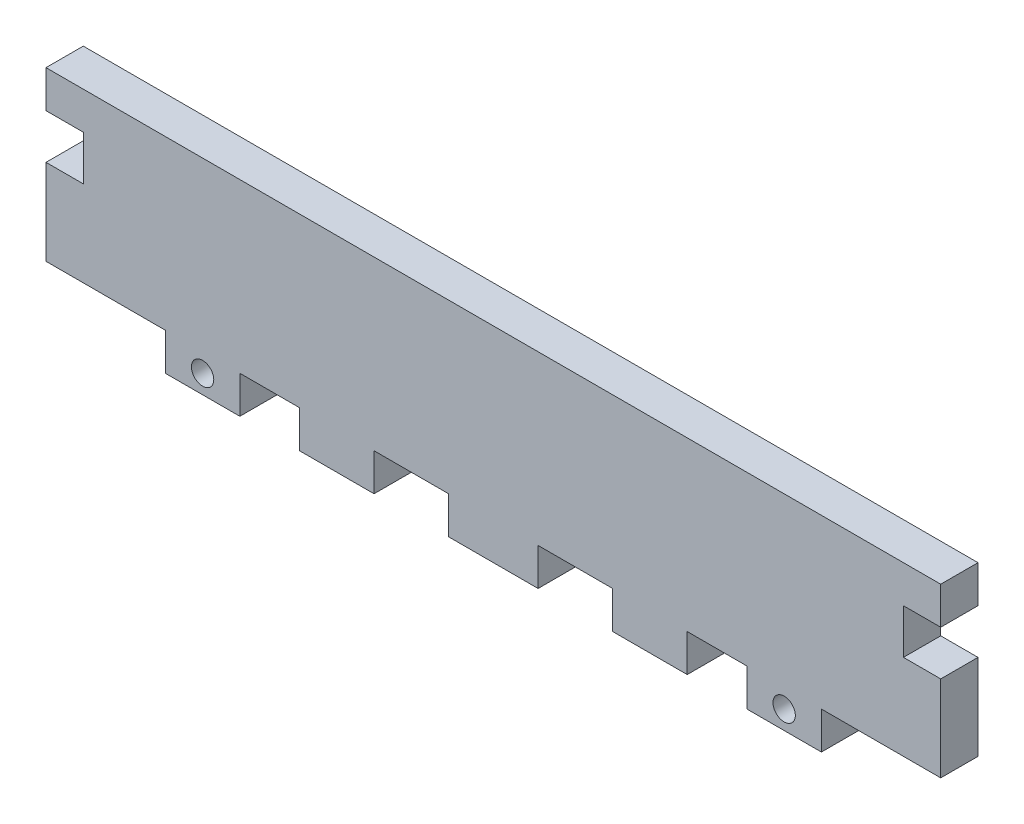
ISO-10303-21;
HEADER;
FILE_DESCRIPTION(('STEP AP214'),'2;1');
FILE_NAME('part.step','',(''),(''),'','','');
FILE_SCHEMA(('AUTOMOTIVE_DESIGN { 1 0 10303 214 1 1 1 1 }'));
ENDSEC;
DATA;
#1=APPLICATION_CONTEXT('core data for automotive mechanical design processes');
#2=APPLICATION_PROTOCOL_DEFINITION('international standard','automotive_design',2000,#1);
#3=PRODUCT_CONTEXT('',#1,'mechanical');
#4=PRODUCT('Part','Part','',(#3));
#5=PRODUCT_RELATED_PRODUCT_CATEGORY('part','',(#4));
#6=PRODUCT_DEFINITION_FORMATION('','',#4);
#7=PRODUCT_DEFINITION_CONTEXT('part definition',#1,'design');
#8=PRODUCT_DEFINITION('design','',#6,#7);
#9=PRODUCT_DEFINITION_SHAPE('','',#8);
#10=(LENGTH_UNIT() NAMED_UNIT(*) SI_UNIT(.MILLI.,.METRE.));
#11=(NAMED_UNIT(*) PLANE_ANGLE_UNIT() SI_UNIT($,.RADIAN.));
#12=(NAMED_UNIT(*) SI_UNIT($,.STERADIAN.) SOLID_ANGLE_UNIT());
#13=UNCERTAINTY_MEASURE_WITH_UNIT(LENGTH_MEASURE(1.E-05),#10,'distance_accuracy_value','');
#14=(GEOMETRIC_REPRESENTATION_CONTEXT(3) GLOBAL_UNCERTAINTY_ASSIGNED_CONTEXT((#13)) GLOBAL_UNIT_ASSIGNED_CONTEXT((#10,
#11,#12)) REPRESENTATION_CONTEXT('',''));
#15=CARTESIAN_POINT('',(0.,0.,0.));
#16=DIRECTION('',(0.,0.,1.));
#17=DIRECTION('',(1.,0.,0.));
#18=AXIS2_PLACEMENT_3D('',#15,#16,#17);
#19=CARTESIAN_POINT('',(0.,0.,6.35));
#20=DIRECTION('',(0.,1.,0.));
#21=DIRECTION('',(-1.,0.,0.));
#22=AXIS2_PLACEMENT_3D('',#19,#20,#21);
#23=PLANE('',#22);
#24=DIRECTION('',(0.,0.,-1.));
#25=VECTOR('',#24,1.);
#26=CARTESIAN_POINT('',(-55.88,0.,6.35));
#27=LINE('',#26,#25);
#28=CARTESIAN_POINT('',(-55.88,0.,6.35));
#29=VERTEX_POINT('',#28);
#30=CARTESIAN_POINT('',(-55.88,0.,0.));
#31=VERTEX_POINT('',#30);
#32=EDGE_CURVE('E73',#29,#31,#27,.T.);
#33=ORIENTED_EDGE('',*,*,#32,.F.);
#34=DIRECTION('',(1.,0.,0.));
#35=VECTOR('',#34,1.);
#36=CARTESIAN_POINT('',(0.,0.,6.35));
#37=LINE('',#36,#35);
#38=CARTESIAN_POINT('',(-68.58,0.,6.35));
#39=VERTEX_POINT('',#38);
#40=EDGE_CURVE('E633',#39,#29,#37,.T.);
#41=ORIENTED_EDGE('',*,*,#40,.F.);
#42=DIRECTION('',(0.,0.,1.));
#43=VECTOR('',#42,1.);
#44=CARTESIAN_POINT('',(-68.58,0.,0.));
#45=LINE('',#44,#43);
#46=CARTESIAN_POINT('',(-68.58,0.,0.));
#47=VERTEX_POINT('',#46);
#48=EDGE_CURVE('E404',#47,#39,#45,.T.);
#49=ORIENTED_EDGE('',*,*,#48,.F.);
#50=DIRECTION('',(1.,0.,0.));
#51=VECTOR('',#50,1.);
#52=CARTESIAN_POINT('',(0.,0.,0.));
#53=LINE('',#52,#51);
#54=EDGE_CURVE('E270',#47,#31,#53,.T.);
#55=ORIENTED_EDGE('',*,*,#54,.T.);
#56=EDGE_LOOP('',(#33,#41,#49,#55));
#57=FACE_BOUND('',#56,.T.);
#58=ADVANCED_FACE('F47',(#57),#23,.F.);
#59=DIRECTION('',(0.,0.,1.));
#60=VECTOR('',#59,1.);
#61=CARTESIAN_POINT('',(-43.18,0.,6.35));
#62=LINE('',#61,#60);
#63=CARTESIAN_POINT('',(-43.18,0.,0.));
#64=VERTEX_POINT('',#63);
#65=CARTESIAN_POINT('',(-43.18,0.,6.35));
#66=VERTEX_POINT('',#65);
#67=EDGE_CURVE('E274',#64,#66,#62,.T.);
#68=ORIENTED_EDGE('',*,*,#67,.F.);
#69=CARTESIAN_POINT('',(-33.02,0.,0.));
#70=VERTEX_POINT('',#69);
#71=EDGE_CURVE('E259',#64,#70,#53,.T.);
#72=ORIENTED_EDGE('',*,*,#71,.T.);
#73=DIRECTION('',(0.,0.,-1.));
#74=VECTOR('',#73,1.);
#75=CARTESIAN_POINT('',(-33.02,0.,6.35));
#76=LINE('',#75,#74);
#77=CARTESIAN_POINT('',(-33.02,0.,6.35));
#78=VERTEX_POINT('',#77);
#79=EDGE_CURVE('E327',#78,#70,#76,.T.);
#80=ORIENTED_EDGE('',*,*,#79,.F.);
#81=EDGE_CURVE('E65',#66,#78,#37,.T.);
#82=ORIENTED_EDGE('',*,*,#81,.F.);
#83=EDGE_LOOP('',(#68,#72,#80,#82));
#84=FACE_BOUND('',#83,.T.);
#85=ADVANCED_FACE('F275',(#84),#23,.F.);
#86=DIRECTION('',(0.,0.,1.));
#87=VECTOR('',#86,1.);
#88=CARTESIAN_POINT('',(-20.32,0.,6.35));
#89=LINE('',#88,#87);
#90=CARTESIAN_POINT('',(-20.32,0.,0.));
#91=VERTEX_POINT('',#90);
#92=CARTESIAN_POINT('',(-20.32,0.,6.35));
#93=VERTEX_POINT('',#92);
#94=EDGE_CURVE('E330',#91,#93,#89,.T.);
#95=ORIENTED_EDGE('',*,*,#94,.F.);
#96=CARTESIAN_POINT('',(0.,0.,0.));
#97=VERTEX_POINT('',#96);
#98=EDGE_CURVE('E271',#91,#97,#53,.T.);
#99=ORIENTED_EDGE('',*,*,#98,.T.);
#100=DIRECTION('',(0.,0.,-1.));
#101=VECTOR('',#100,1.);
#102=CARTESIAN_POINT('',(0.,0.,6.35));
#103=LINE('',#102,#101);
#104=CARTESIAN_POINT('',(0.,0.,6.35));
#105=VERTEX_POINT('',#104);
#106=EDGE_CURVE('E548',#105,#97,#103,.T.);
#107=ORIENTED_EDGE('',*,*,#106,.F.);
#108=EDGE_CURVE('E627',#93,#105,#37,.T.);
#109=ORIENTED_EDGE('',*,*,#108,.F.);
#110=EDGE_LOOP('',(#95,#99,#107,#109));
#111=FACE_BOUND('',#110,.T.);
#112=ADVANCED_FACE('F663',(#111),#23,.F.);
#113=DIRECTION('',(0.,0.,-1.));
#114=VECTOR('',#113,1.);
#115=CARTESIAN_POINT('',(-109.22,0.,6.35));
#116=LINE('',#115,#114);
#117=CARTESIAN_POINT('',(-109.22,0.,6.35));
#118=VERTEX_POINT('',#117);
#119=CARTESIAN_POINT('',(-109.22,0.,0.));
#120=VERTEX_POINT('',#119);
#121=EDGE_CURVE('E367',#118,#120,#116,.T.);
#122=ORIENTED_EDGE('',*,*,#121,.F.);
#123=CARTESIAN_POINT('',(-119.38,0.,6.35));
#124=VERTEX_POINT('',#123);
#125=EDGE_CURVE('E482',#124,#118,#37,.T.);
#126=ORIENTED_EDGE('',*,*,#125,.F.);
#127=DIRECTION('',(0.,0.,1.));
#128=VECTOR('',#127,1.);
#129=CARTESIAN_POINT('',(-119.38,0.,6.35));
#130=LINE('',#129,#128);
#131=CARTESIAN_POINT('',(-119.38,0.,0.));
#132=VERTEX_POINT('',#131);
#133=EDGE_CURVE('E426',#132,#124,#130,.T.);
#134=ORIENTED_EDGE('',*,*,#133,.F.);
#135=EDGE_CURVE('E517',#132,#120,#53,.T.);
#136=ORIENTED_EDGE('',*,*,#135,.T.);
#137=EDGE_LOOP('',(#122,#126,#134,#136));
#138=FACE_BOUND('',#137,.T.);
#139=ADVANCED_FACE('F735',(#138),#23,.F.);
#140=DIRECTION('',(0.,0.,1.));
#141=VECTOR('',#140,1.);
#142=CARTESIAN_POINT('',(-96.52,0.,6.35));
#143=LINE('',#142,#141);
#144=CARTESIAN_POINT('',(-96.52,0.,0.));
#145=VERTEX_POINT('',#144);
#146=CARTESIAN_POINT('',(-96.52,0.,6.35));
#147=VERTEX_POINT('',#146);
#148=EDGE_CURVE('E363',#145,#147,#143,.T.);
#149=ORIENTED_EDGE('',*,*,#148,.F.);
#150=CARTESIAN_POINT('',(-83.82,0.,0.));
#151=VERTEX_POINT('',#150);
#152=EDGE_CURVE('E686',#145,#151,#53,.T.);
#153=ORIENTED_EDGE('',*,*,#152,.T.);
#154=DIRECTION('',(0.,0.,-1.));
#155=VECTOR('',#154,1.);
#156=CARTESIAN_POINT('',(-83.82,0.,0.));
#157=LINE('',#156,#155);
#158=CARTESIAN_POINT('',(-83.82,0.,6.35));
#159=VERTEX_POINT('',#158);
#160=EDGE_CURVE('E400',#159,#151,#157,.T.);
#161=ORIENTED_EDGE('',*,*,#160,.F.);
#162=EDGE_CURVE('E629',#147,#159,#37,.T.);
#163=ORIENTED_EDGE('',*,*,#162,.F.);
#164=EDGE_LOOP('',(#149,#153,#161,#163));
#165=FACE_BOUND('',#164,.T.);
#166=ADVANCED_FACE('F722',(#165),#23,.F.);
#167=DIRECTION('',(0.,0.,-1.));
#168=VECTOR('',#167,1.);
#169=CARTESIAN_POINT('',(-132.08,0.,6.35));
#170=LINE('',#169,#168);
#171=CARTESIAN_POINT('',(-132.08,0.,6.35));
#172=VERTEX_POINT('',#171);
#173=CARTESIAN_POINT('',(-132.08,0.,0.));
#174=VERTEX_POINT('',#173);
#175=EDGE_CURVE('E409',#172,#174,#170,.T.);
#176=ORIENTED_EDGE('',*,*,#175,.F.);
#177=CARTESIAN_POINT('',(-152.4,0.,6.35));
#178=VERTEX_POINT('',#177);
#179=EDGE_CURVE('E477',#178,#172,#37,.T.);
#180=ORIENTED_EDGE('',*,*,#179,.F.);
#181=DIRECTION('',(0.,0.,-1.));
#182=VECTOR('',#181,1.);
#183=CARTESIAN_POINT('',(-152.4,0.,6.35));
#184=LINE('',#183,#182);
#185=CARTESIAN_POINT('',(-152.4,0.,0.));
#186=VERTEX_POINT('',#185);
#187=EDGE_CURVE('E552',#178,#186,#184,.T.);
#188=ORIENTED_EDGE('',*,*,#187,.T.);
#189=EDGE_CURVE('E273',#186,#174,#53,.T.);
#190=ORIENTED_EDGE('',*,*,#189,.T.);
#191=EDGE_LOOP('',(#176,#180,#188,#190));
#192=FACE_BOUND('',#191,.T.);
#193=ADVANCED_FACE('F692',(#192),#23,.F.);
#194=CARTESIAN_POINT('',(0.,28.575,6.35));
#195=DIRECTION('',(0.,1.,0.));
#196=DIRECTION('',(-1.,0.,0.));
#197=AXIS2_PLACEMENT_3D('',#194,#195,#196);
#198=PLANE('',#197);
#199=DIRECTION('',(1.,0.,0.));
#200=VECTOR('',#199,1.);
#201=CARTESIAN_POINT('',(0.,28.575,0.));
#202=LINE('',#201,#200);
#203=CARTESIAN_POINT('',(-152.4,28.575,0.));
#204=VERTEX_POINT('',#203);
#205=CARTESIAN_POINT('',(0.,28.575,0.));
#206=VERTEX_POINT('',#205);
#207=EDGE_CURVE('E457',#204,#206,#202,.T.);
#208=ORIENTED_EDGE('',*,*,#207,.F.);
#209=DIRECTION('',(0.,0.,-1.));
#210=VECTOR('',#209,1.);
#211=CARTESIAN_POINT('',(-152.4,28.575,6.35));
#212=LINE('',#211,#210);
#213=CARTESIAN_POINT('',(-152.4,28.575,6.35));
#214=VERTEX_POINT('',#213);
#215=EDGE_CURVE('E11',#214,#204,#212,.T.);
#216=ORIENTED_EDGE('',*,*,#215,.F.);
#217=DIRECTION('',(1.,0.,0.));
#218=VECTOR('',#217,1.);
#219=CARTESIAN_POINT('',(0.,28.575,6.35));
#220=LINE('',#219,#218);
#221=CARTESIAN_POINT('',(0.,28.575,6.35));
#222=VERTEX_POINT('',#221);
#223=EDGE_CURVE('E458',#214,#222,#220,.T.);
#224=ORIENTED_EDGE('',*,*,#223,.T.);
#225=DIRECTION('',(0.,0.,-1.));
#226=VECTOR('',#225,1.);
#227=CARTESIAN_POINT('',(0.,28.575,6.35));
#228=LINE('',#227,#226);
#229=EDGE_CURVE('E533',#222,#206,#228,.T.);
#230=ORIENTED_EDGE('',*,*,#229,.T.);
#231=EDGE_LOOP('',(#208,#216,#224,#230));
#232=FACE_BOUND('',#231,.T.);
#233=ADVANCED_FACE('F49',(#232),#198,.T.);
#234=CARTESIAN_POINT('',(-152.4,0.,6.35));
#235=DIRECTION('',(1.,0.,0.));
#236=DIRECTION('',(0.,0.,-1.));
#237=AXIS2_PLACEMENT_3D('',#234,#235,#236);
#238=PLANE('',#237);
#239=DIRECTION('',(0.,-1.,0.));
#240=VECTOR('',#239,1.);
#241=CARTESIAN_POINT('',(-152.4,0.,0.));
#242=LINE('',#241,#240);
#243=CARTESIAN_POINT('',(-152.4,22.225,0.));
#244=VERTEX_POINT('',#243);
#245=EDGE_CURVE('E500',#204,#244,#242,.T.);
#246=ORIENTED_EDGE('',*,*,#245,.T.);
#247=DIRECTION('',(0.,0.,-1.));
#248=VECTOR('',#247,1.);
#249=CARTESIAN_POINT('',(-152.4,22.225,6.35));
#250=LINE('',#249,#248);
#251=CARTESIAN_POINT('',(-152.4,22.225,6.35));
#252=VERTEX_POINT('',#251);
#253=EDGE_CURVE('E57',#252,#244,#250,.T.);
#254=ORIENTED_EDGE('',*,*,#253,.F.);
#255=DIRECTION('',(0.,-1.,0.));
#256=VECTOR('',#255,1.);
#257=CARTESIAN_POINT('',(-152.4,0.,6.35));
#258=LINE('',#257,#256);
#259=EDGE_CURVE('E462',#214,#252,#258,.T.);
#260=ORIENTED_EDGE('',*,*,#259,.F.);
#261=ORIENTED_EDGE('',*,*,#215,.T.);
#262=EDGE_LOOP('',(#246,#254,#260,#261));
#263=FACE_BOUND('',#262,.T.);
#264=ADVANCED_FACE('F605',(#263),#238,.F.);
#265=CARTESIAN_POINT('',(0.,22.225,6.35));
#266=DIRECTION('',(0.,1.,0.));
#267=DIRECTION('',(0.,0.,1.));
#268=AXIS2_PLACEMENT_3D('',#265,#266,#267);
#269=PLANE('',#268);
#270=DIRECTION('',(1.,0.,0.));
#271=VECTOR('',#270,1.);
#272=CARTESIAN_POINT('',(0.,22.225,0.));
#273=LINE('',#272,#271);
#274=CARTESIAN_POINT('',(-146.05,22.225,0.));
#275=VERTEX_POINT('',#274);
#276=EDGE_CURVE('E503',#244,#275,#273,.T.);
#277=ORIENTED_EDGE('',*,*,#276,.T.);
#278=DIRECTION('',(0.,0.,-1.));
#279=VECTOR('',#278,1.);
#280=CARTESIAN_POINT('',(-146.05,22.225,6.35));
#281=LINE('',#280,#279);
#282=CARTESIAN_POINT('',(-146.05,22.225,6.35));
#283=VERTEX_POINT('',#282);
#284=EDGE_CURVE('E562',#283,#275,#281,.T.);
#285=ORIENTED_EDGE('',*,*,#284,.F.);
#286=DIRECTION('',(1.,0.,0.));
#287=VECTOR('',#286,1.);
#288=CARTESIAN_POINT('',(0.,22.225,6.35));
#289=LINE('',#288,#287);
#290=EDGE_CURVE('E466',#252,#283,#289,.T.);
#291=ORIENTED_EDGE('',*,*,#290,.F.);
#292=ORIENTED_EDGE('',*,*,#253,.T.);
#293=EDGE_LOOP('',(#277,#285,#291,#292));
#294=FACE_BOUND('',#293,.T.);
#295=ADVANCED_FACE('F610',(#294),#269,.F.);
#296=CARTESIAN_POINT('',(-146.05,0.,6.35));
#297=DIRECTION('',(1.,0.,0.));
#298=DIRECTION('',(0.,0.,-1.));
#299=AXIS2_PLACEMENT_3D('',#296,#297,#298);
#300=PLANE('',#299);
#301=DIRECTION('',(0.,-1.,0.));
#302=VECTOR('',#301,1.);
#303=CARTESIAN_POINT('',(-146.05,0.,0.));
#304=LINE('',#303,#302);
#305=CARTESIAN_POINT('',(-146.05,14.605,0.));
#306=VERTEX_POINT('',#305);
#307=EDGE_CURVE('E507',#275,#306,#304,.T.);
#308=ORIENTED_EDGE('',*,*,#307,.T.);
#309=DIRECTION('',(0.,0.,-1.));
#310=VECTOR('',#309,1.);
#311=CARTESIAN_POINT('',(-146.05,14.605,6.35));
#312=LINE('',#311,#310);
#313=CARTESIAN_POINT('',(-146.05,14.605,6.35));
#314=VERTEX_POINT('',#313);
#315=EDGE_CURVE('E559',#314,#306,#312,.T.);
#316=ORIENTED_EDGE('',*,*,#315,.F.);
#317=DIRECTION('',(0.,-1.,0.));
#318=VECTOR('',#317,1.);
#319=CARTESIAN_POINT('',(-146.05,0.,6.35));
#320=LINE('',#319,#318);
#321=EDGE_CURVE('E470',#283,#314,#320,.T.);
#322=ORIENTED_EDGE('',*,*,#321,.F.);
#323=ORIENTED_EDGE('',*,*,#284,.T.);
#324=EDGE_LOOP('',(#308,#316,#322,#323));
#325=FACE_BOUND('',#324,.T.);
#326=ADVANCED_FACE('F615',(#325),#300,.F.);
#327=CARTESIAN_POINT('',(0.,14.605,6.35));
#328=DIRECTION('',(0.,1.,0.));
#329=DIRECTION('',(0.,0.,1.));
#330=AXIS2_PLACEMENT_3D('',#327,#328,#329);
#331=PLANE('',#330);
#332=DIRECTION('',(1.,0.,0.));
#333=VECTOR('',#332,1.);
#334=CARTESIAN_POINT('',(0.,14.605,0.));
#335=LINE('',#334,#333);
#336=CARTESIAN_POINT('',(-152.4,14.605,0.));
#337=VERTEX_POINT('',#336);
#338=EDGE_CURVE('E511',#337,#306,#335,.T.);
#339=ORIENTED_EDGE('',*,*,#338,.F.);
#340=DIRECTION('',(0.,0.,-1.));
#341=VECTOR('',#340,1.);
#342=CARTESIAN_POINT('',(-152.4,14.605,6.35));
#343=LINE('',#342,#341);
#344=CARTESIAN_POINT('',(-152.4,14.605,6.35));
#345=VERTEX_POINT('',#344);
#346=EDGE_CURVE('E556',#345,#337,#343,.T.);
#347=ORIENTED_EDGE('',*,*,#346,.F.);
#348=DIRECTION('',(1.,0.,0.));
#349=VECTOR('',#348,1.);
#350=CARTESIAN_POINT('',(0.,14.605,6.35));
#351=LINE('',#350,#349);
#352=EDGE_CURVE('E473',#345,#314,#351,.T.);
#353=ORIENTED_EDGE('',*,*,#352,.T.);
#354=ORIENTED_EDGE('',*,*,#315,.T.);
#355=EDGE_LOOP('',(#339,#347,#353,#354));
#356=FACE_BOUND('',#355,.T.);
#357=ADVANCED_FACE('F619',(#356),#331,.T.);
#358=EDGE_CURVE('E504',#337,#186,#242,.T.);
#359=ORIENTED_EDGE('',*,*,#358,.T.);
#360=ORIENTED_EDGE('',*,*,#187,.F.);
#361=EDGE_CURVE('E467',#345,#178,#258,.T.);
#362=ORIENTED_EDGE('',*,*,#361,.F.);
#363=ORIENTED_EDGE('',*,*,#346,.T.);
#364=EDGE_LOOP('',(#359,#360,#362,#363));
#365=FACE_BOUND('',#364,.T.);
#366=ADVANCED_FACE('F624',(#365),#238,.F.);
#367=CARTESIAN_POINT('',(0.,0.,6.35));
#368=DIRECTION('',(1.,0.,0.));
#369=DIRECTION('',(0.,0.,-1.));
#370=AXIS2_PLACEMENT_3D('',#367,#368,#369);
#371=PLANE('',#370);
#372=DIRECTION('',(0.,-1.,0.));
#373=VECTOR('',#372,1.);
#374=CARTESIAN_POINT('',(0.,0.,0.));
#375=LINE('',#374,#373);
#376=CARTESIAN_POINT('',(0.,14.605,0.));
#377=VERTEX_POINT('',#376);
#378=EDGE_CURVE('E516',#377,#97,#375,.T.);
#379=ORIENTED_EDGE('',*,*,#378,.F.);
#380=DIRECTION('',(0.,0.,-1.));
#381=VECTOR('',#380,1.);
#382=CARTESIAN_POINT('',(0.,14.605,6.35));
#383=LINE('',#382,#381);
#384=CARTESIAN_POINT('',(0.,14.605,6.35));
#385=VERTEX_POINT('',#384);
#386=EDGE_CURVE('E545',#385,#377,#383,.T.);
#387=ORIENTED_EDGE('',*,*,#386,.F.);
#388=DIRECTION('',(0.,-1.,0.));
#389=VECTOR('',#388,1.);
#390=CARTESIAN_POINT('',(0.,0.,6.35));
#391=LINE('',#390,#389);
#392=EDGE_CURVE('E481',#385,#105,#391,.T.);
#393=ORIENTED_EDGE('',*,*,#392,.T.);
#394=ORIENTED_EDGE('',*,*,#106,.T.);
#395=EDGE_LOOP('',(#379,#387,#393,#394));
#396=FACE_BOUND('',#395,.T.);
#397=ADVANCED_FACE('F666',(#396),#371,.T.);
#398=CARTESIAN_POINT('',(0.,14.605,6.35));
#399=DIRECTION('',(0.,-1.,0.));
#400=DIRECTION('',(1.,0.,0.));
#401=AXIS2_PLACEMENT_3D('',#398,#399,#400);
#402=PLANE('',#401);
#403=DIRECTION('',(-1.,0.,0.));
#404=VECTOR('',#403,1.);
#405=CARTESIAN_POINT('',(0.,14.605,0.));
#406=LINE('',#405,#404);
#407=CARTESIAN_POINT('',(-6.35,14.605,0.));
#408=VERTEX_POINT('',#407);
#409=EDGE_CURVE('E521',#377,#408,#406,.T.);
#410=ORIENTED_EDGE('',*,*,#409,.T.);
#411=DIRECTION('',(0.,0.,-1.));
#412=VECTOR('',#411,1.);
#413=CARTESIAN_POINT('',(-6.35,14.605,6.35));
#414=LINE('',#413,#412);
#415=CARTESIAN_POINT('',(-6.35,14.605,6.35));
#416=VERTEX_POINT('',#415);
#417=EDGE_CURVE('E542',#416,#408,#414,.T.);
#418=ORIENTED_EDGE('',*,*,#417,.F.);
#419=DIRECTION('',(-1.,0.,0.));
#420=VECTOR('',#419,1.);
#421=CARTESIAN_POINT('',(0.,14.605,6.35));
#422=LINE('',#421,#420);
#423=EDGE_CURVE('E486',#385,#416,#422,.T.);
#424=ORIENTED_EDGE('',*,*,#423,.F.);
#425=ORIENTED_EDGE('',*,*,#386,.T.);
#426=EDGE_LOOP('',(#410,#418,#424,#425));
#427=FACE_BOUND('',#426,.T.);
#428=ADVANCED_FACE('F671',(#427),#402,.F.);
#429=CARTESIAN_POINT('',(-6.34999999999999,0.,6.35));
#430=DIRECTION('',(1.,0.,0.));
#431=DIRECTION('',(0.,1.,0.));
#432=AXIS2_PLACEMENT_3D('',#429,#430,#431);
#433=PLANE('',#432);
#434=DIRECTION('',(0.,-1.,0.));
#435=VECTOR('',#434,1.);
#436=CARTESIAN_POINT('',(-6.34999999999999,0.,0.));
#437=LINE('',#436,#435);
#438=CARTESIAN_POINT('',(-6.35,22.225,0.));
#439=VERTEX_POINT('',#438);
#440=EDGE_CURVE('E525',#439,#408,#437,.T.);
#441=ORIENTED_EDGE('',*,*,#440,.F.);
#442=DIRECTION('',(0.,0.,-1.));
#443=VECTOR('',#442,1.);
#444=CARTESIAN_POINT('',(-6.35,22.225,6.35));
#445=LINE('',#444,#443);
#446=CARTESIAN_POINT('',(-6.35,22.225,6.35));
#447=VERTEX_POINT('',#446);
#448=EDGE_CURVE('E539',#447,#439,#445,.T.);
#449=ORIENTED_EDGE('',*,*,#448,.F.);
#450=DIRECTION('',(0.,-1.,0.));
#451=VECTOR('',#450,1.);
#452=CARTESIAN_POINT('',(-6.34999999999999,0.,6.35));
#453=LINE('',#452,#451);
#454=EDGE_CURVE('E490',#447,#416,#453,.T.);
#455=ORIENTED_EDGE('',*,*,#454,.T.);
#456=ORIENTED_EDGE('',*,*,#417,.T.);
#457=EDGE_LOOP('',(#441,#449,#455,#456));
#458=FACE_BOUND('',#457,.T.);
#459=ADVANCED_FACE('F675',(#458),#433,.T.);
#460=CARTESIAN_POINT('',(0.,22.225,6.35));
#461=DIRECTION('',(0.,-1.,0.));
#462=DIRECTION('',(0.,0.,-1.));
#463=AXIS2_PLACEMENT_3D('',#460,#461,#462);
#464=PLANE('',#463);
#465=DIRECTION('',(-1.,0.,0.));
#466=VECTOR('',#465,1.);
#467=CARTESIAN_POINT('',(0.,22.225,0.));
#468=LINE('',#467,#466);
#469=CARTESIAN_POINT('',(0.,22.225,0.));
#470=VERTEX_POINT('',#469);
#471=EDGE_CURVE('E529',#470,#439,#468,.T.);
#472=ORIENTED_EDGE('',*,*,#471,.F.);
#473=DIRECTION('',(0.,0.,-1.));
#474=VECTOR('',#473,1.);
#475=CARTESIAN_POINT('',(0.,22.225,6.35));
#476=LINE('',#475,#474);
#477=CARTESIAN_POINT('',(0.,22.225,6.35));
#478=VERTEX_POINT('',#477);
#479=EDGE_CURVE('E536',#478,#470,#476,.T.);
#480=ORIENTED_EDGE('',*,*,#479,.F.);
#481=DIRECTION('',(-1.,0.,0.));
#482=VECTOR('',#481,1.);
#483=CARTESIAN_POINT('',(0.,22.225,6.35));
#484=LINE('',#483,#482);
#485=EDGE_CURVE('E494',#478,#447,#484,.T.);
#486=ORIENTED_EDGE('',*,*,#485,.T.);
#487=ORIENTED_EDGE('',*,*,#448,.T.);
#488=EDGE_LOOP('',(#472,#480,#486,#487));
#489=FACE_BOUND('',#488,.T.);
#490=ADVANCED_FACE('F678',(#489),#464,.T.);
#491=EDGE_CURVE('E463',#206,#470,#375,.T.);
#492=ORIENTED_EDGE('',*,*,#491,.F.);
#493=ORIENTED_EDGE('',*,*,#229,.F.);
#494=EDGE_CURVE('E487',#222,#478,#391,.T.);
#495=ORIENTED_EDGE('',*,*,#494,.T.);
#496=ORIENTED_EDGE('',*,*,#479,.T.);
#497=EDGE_LOOP('',(#492,#493,#495,#496));
#498=FACE_BOUND('',#497,.T.);
#499=ADVANCED_FACE('F592',(#498),#371,.T.);
#500=CARTESIAN_POINT('',(0.,0.,6.35));
#501=DIRECTION('',(0.,0.,1.));
#502=DIRECTION('',(1.,0.,0.));
#503=AXIS2_PLACEMENT_3D('',#500,#501,#502);
#504=PLANE('',#503);
#505=CARTESIAN_POINT('',(-125.73,-3.17500000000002,6.35));
#506=DIRECTION('',(0.,0.,1.));
#507=DIRECTION('',(1.,0.,0.));
#508=AXIS2_PLACEMENT_3D('',#505,#506,#507);
#509=CIRCLE('',#508,1.90500000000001);
#510=CARTESIAN_POINT('',(-123.825,-3.17500000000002,6.35));
#511=VERTEX_POINT('',#510);
#512=EDGE_CURVE('E571',#511,#511,#509,.T.);
#513=ORIENTED_EDGE('',*,*,#512,.F.);
#514=EDGE_LOOP('',(#513));
#515=FACE_BOUND('',#514,.T.);
#516=CARTESIAN_POINT('',(-26.67,-3.175,6.35));
#517=DIRECTION('',(0.,0.,1.));
#518=DIRECTION('',(1.,0.,0.));
#519=AXIS2_PLACEMENT_3D('',#516,#517,#518);
#520=CIRCLE('',#519,1.905);
#521=CARTESIAN_POINT('',(-24.765,-3.175,6.35));
#522=VERTEX_POINT('',#521);
#523=EDGE_CURVE('E578',#522,#522,#520,.T.);
#524=ORIENTED_EDGE('',*,*,#523,.F.);
#525=EDGE_LOOP('',(#524));
#526=FACE_BOUND('',#525,.T.);
#527=ORIENTED_EDGE('',*,*,#223,.F.);
#528=ORIENTED_EDGE('',*,*,#259,.T.);
#529=ORIENTED_EDGE('',*,*,#290,.T.);
#530=ORIENTED_EDGE('',*,*,#321,.T.);
#531=ORIENTED_EDGE('',*,*,#352,.F.);
#532=ORIENTED_EDGE('',*,*,#361,.T.);
#533=ORIENTED_EDGE('',*,*,#179,.T.);
#534=DIRECTION('',(0.,1.,0.));
#535=VECTOR('',#534,1.);
#536=CARTESIAN_POINT('',(-132.08,-6.35000000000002,6.35));
#537=LINE('',#536,#535);
#538=CARTESIAN_POINT('',(-132.08,-6.35000000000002,6.35));
#539=VERTEX_POINT('',#538);
#540=EDGE_CURVE('E435',#539,#172,#537,.T.);
#541=ORIENTED_EDGE('',*,*,#540,.F.);
#542=DIRECTION('',(-1.,0.,0.));
#543=VECTOR('',#542,1.);
#544=CARTESIAN_POINT('',(-132.08,-6.35000000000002,6.35));
#545=LINE('',#544,#543);
#546=CARTESIAN_POINT('',(-119.38,-6.35000000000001,6.35));
#547=VERTEX_POINT('',#546);
#548=EDGE_CURVE('E432',#547,#539,#545,.T.);
#549=ORIENTED_EDGE('',*,*,#548,.F.);
#550=DIRECTION('',(0.,1.,0.));
#551=VECTOR('',#550,1.);
#552=CARTESIAN_POINT('',(-119.38,-6.35000000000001,6.35));
#553=LINE('',#552,#551);
#554=EDGE_CURVE('E445',#547,#124,#553,.T.);
#555=ORIENTED_EDGE('',*,*,#554,.T.);
#556=ORIENTED_EDGE('',*,*,#125,.T.);
#557=DIRECTION('',(0.,1.,0.));
#558=VECTOR('',#557,1.);
#559=CARTESIAN_POINT('',(-109.22,-6.35000000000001,6.35));
#560=LINE('',#559,#558);
#561=CARTESIAN_POINT('',(-109.22,-6.35000000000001,6.35));
#562=VERTEX_POINT('',#561);
#563=EDGE_CURVE('E358',#562,#118,#560,.T.);
#564=ORIENTED_EDGE('',*,*,#563,.F.);
#565=DIRECTION('',(-1.,0.,0.));
#566=VECTOR('',#565,1.);
#567=CARTESIAN_POINT('',(-109.22,-6.35000000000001,6.35));
#568=LINE('',#567,#566);
#569=CARTESIAN_POINT('',(-96.52,-6.35000000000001,6.35));
#570=VERTEX_POINT('',#569);
#571=EDGE_CURVE('E362',#570,#562,#568,.T.);
#572=ORIENTED_EDGE('',*,*,#571,.F.);
#573=DIRECTION('',(0.,1.,0.));
#574=VECTOR('',#573,1.);
#575=CARTESIAN_POINT('',(-96.52,-6.35000000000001,6.35));
#576=LINE('',#575,#574);
#577=EDGE_CURVE('E354',#570,#147,#576,.T.);
#578=ORIENTED_EDGE('',*,*,#577,.T.);
#579=ORIENTED_EDGE('',*,*,#162,.T.);
#580=DIRECTION('',(0.,1.,0.));
#581=VECTOR('',#580,1.);
#582=CARTESIAN_POINT('',(-83.82,-6.35000000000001,6.35));
#583=LINE('',#582,#581);
#584=CARTESIAN_POINT('',(-83.82,-6.35000000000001,6.35));
#585=VERTEX_POINT('',#584);
#586=EDGE_CURVE('E387',#585,#159,#583,.T.);
#587=ORIENTED_EDGE('',*,*,#586,.F.);
#588=DIRECTION('',(-1.,0.,0.));
#589=VECTOR('',#588,1.);
#590=CARTESIAN_POINT('',(-83.82,-6.35000000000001,6.35));
#591=LINE('',#590,#589);
#592=CARTESIAN_POINT('',(-68.58,-6.35000000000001,6.35));
#593=VERTEX_POINT('',#592);
#594=EDGE_CURVE('E415',#593,#585,#591,.T.);
#595=ORIENTED_EDGE('',*,*,#594,.F.);
#596=DIRECTION('',(0.,1.,0.));
#597=VECTOR('',#596,1.);
#598=CARTESIAN_POINT('',(-68.58,-6.35000000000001,6.35));
#599=LINE('',#598,#597);
#600=EDGE_CURVE('E372',#593,#39,#599,.T.);
#601=ORIENTED_EDGE('',*,*,#600,.T.);
#602=ORIENTED_EDGE('',*,*,#40,.T.);
#603=DIRECTION('',(0.,1.,0.));
#604=VECTOR('',#603,1.);
#605=CARTESIAN_POINT('',(-55.88,-6.35000000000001,6.35));
#606=LINE('',#605,#604);
#607=CARTESIAN_POINT('',(-55.88,-6.35000000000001,6.35));
#608=VERTEX_POINT('',#607);
#609=EDGE_CURVE('E290',#608,#29,#606,.T.);
#610=ORIENTED_EDGE('',*,*,#609,.F.);
#611=DIRECTION('',(-1.,0.,0.));
#612=VECTOR('',#611,1.);
#613=CARTESIAN_POINT('',(-55.88,-6.35000000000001,6.35));
#614=LINE('',#613,#612);
#615=CARTESIAN_POINT('',(-43.18,-6.35,6.35));
#616=VERTEX_POINT('',#615);
#617=EDGE_CURVE('E298',#616,#608,#614,.T.);
#618=ORIENTED_EDGE('',*,*,#617,.F.);
#619=DIRECTION('',(0.,1.,0.));
#620=VECTOR('',#619,1.);
#621=CARTESIAN_POINT('',(-43.18,-6.35,6.35));
#622=LINE('',#621,#620);
#623=EDGE_CURVE('E285',#616,#66,#622,.T.);
#624=ORIENTED_EDGE('',*,*,#623,.T.);
#625=ORIENTED_EDGE('',*,*,#81,.T.);
#626=DIRECTION('',(0.,1.,0.));
#627=VECTOR('',#626,1.);
#628=CARTESIAN_POINT('',(-33.02,-6.35,6.35));
#629=LINE('',#628,#627);
#630=CARTESIAN_POINT('',(-33.02,-6.35,6.35));
#631=VERTEX_POINT('',#630);
#632=EDGE_CURVE('E316',#631,#78,#629,.T.);
#633=ORIENTED_EDGE('',*,*,#632,.F.);
#634=DIRECTION('',(-1.,0.,0.));
#635=VECTOR('',#634,1.);
#636=CARTESIAN_POINT('',(-20.32,-6.35,6.35));
#637=LINE('',#636,#635);
#638=CARTESIAN_POINT('',(-20.32,-6.35,6.35));
#639=VERTEX_POINT('',#638);
#640=EDGE_CURVE('E341',#639,#631,#637,.T.);
#641=ORIENTED_EDGE('',*,*,#640,.F.);
#642=DIRECTION('',(0.,1.,0.));
#643=VECTOR('',#642,1.);
#644=CARTESIAN_POINT('',(-20.32,-6.35,6.35));
#645=LINE('',#644,#643);
#646=EDGE_CURVE('E302',#639,#93,#645,.T.);
#647=ORIENTED_EDGE('',*,*,#646,.T.);
#648=ORIENTED_EDGE('',*,*,#108,.T.);
#649=ORIENTED_EDGE('',*,*,#392,.F.);
#650=ORIENTED_EDGE('',*,*,#423,.T.);
#651=ORIENTED_EDGE('',*,*,#454,.F.);
#652=ORIENTED_EDGE('',*,*,#485,.F.);
#653=ORIENTED_EDGE('',*,*,#494,.F.);
#654=EDGE_LOOP('',(#527,#528,#529,#530,#531,#532,#533,#541,#549,#555,#556,#564,#572,#578,#579,
#587,#595,#601,#602,#610,#618,#624,#625,#633,#641,#647,#648,#649,#650,#651,#652,#653));
#655=FACE_BOUND('',#654,.T.);
#656=ADVANCED_FACE('F589',(#515,#526,#655),#504,.T.);
#657=CARTESIAN_POINT('',(0.,0.,0.));
#658=DIRECTION('',(0.,0.,1.));
#659=DIRECTION('',(1.,0.,0.));
#660=AXIS2_PLACEMENT_3D('',#657,#658,#659);
#661=PLANE('',#660);
#662=CARTESIAN_POINT('',(-125.73,-3.17500000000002,0.));
#663=DIRECTION('',(0.,0.,1.));
#664=DIRECTION('',(1.,0.,0.));
#665=AXIS2_PLACEMENT_3D('',#662,#663,#664);
#666=CIRCLE('',#665,1.90500000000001);
#667=CARTESIAN_POINT('',(-123.825,-3.17500000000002,0.));
#668=VERTEX_POINT('',#667);
#669=EDGE_CURVE('E51',#668,#668,#666,.T.);
#670=ORIENTED_EDGE('',*,*,#669,.T.);
#671=EDGE_LOOP('',(#670));
#672=FACE_BOUND('',#671,.T.);
#673=CARTESIAN_POINT('',(-26.67,-3.175,0.));
#674=DIRECTION('',(0.,0.,1.));
#675=DIRECTION('',(1.,0.,0.));
#676=AXIS2_PLACEMENT_3D('',#673,#674,#675);
#677=CIRCLE('',#676,1.905);
#678=CARTESIAN_POINT('',(-24.765,-3.175,0.));
#679=VERTEX_POINT('',#678);
#680=EDGE_CURVE('E568',#679,#679,#677,.T.);
#681=ORIENTED_EDGE('',*,*,#680,.T.);
#682=EDGE_LOOP('',(#681));
#683=FACE_BOUND('',#682,.T.);
#684=ORIENTED_EDGE('',*,*,#207,.T.);
#685=ORIENTED_EDGE('',*,*,#491,.T.);
#686=ORIENTED_EDGE('',*,*,#471,.T.);
#687=ORIENTED_EDGE('',*,*,#440,.T.);
#688=ORIENTED_EDGE('',*,*,#409,.F.);
#689=ORIENTED_EDGE('',*,*,#378,.T.);
#690=ORIENTED_EDGE('',*,*,#98,.F.);
#691=DIRECTION('',(0.,1.,0.));
#692=VECTOR('',#691,1.);
#693=CARTESIAN_POINT('',(-20.32,-6.35,0.));
#694=LINE('',#693,#692);
#695=CARTESIAN_POINT('',(-20.32,-6.35,0.));
#696=VERTEX_POINT('',#695);
#697=EDGE_CURVE('E322',#696,#91,#694,.T.);
#698=ORIENTED_EDGE('',*,*,#697,.F.);
#699=DIRECTION('',(1.,0.,0.));
#700=VECTOR('',#699,1.);
#701=CARTESIAN_POINT('',(-20.32,-6.35,0.));
#702=LINE('',#701,#700);
#703=CARTESIAN_POINT('',(-33.02,-6.35,0.));
#704=VERTEX_POINT('',#703);
#705=EDGE_CURVE('E326',#704,#696,#702,.T.);
#706=ORIENTED_EDGE('',*,*,#705,.F.);
#707=DIRECTION('',(0.,1.,0.));
#708=VECTOR('',#707,1.);
#709=CARTESIAN_POINT('',(-33.02,-6.35,0.));
#710=LINE('',#709,#708);
#711=EDGE_CURVE('E267',#704,#70,#710,.T.);
#712=ORIENTED_EDGE('',*,*,#711,.T.);
#713=ORIENTED_EDGE('',*,*,#71,.F.);
#714=DIRECTION('',(0.,1.,0.));
#715=VECTOR('',#714,1.);
#716=CARTESIAN_POINT('',(-43.18,-6.35,0.));
#717=LINE('',#716,#715);
#718=CARTESIAN_POINT('',(-43.18,-6.35,0.));
#719=VERTEX_POINT('',#718);
#720=EDGE_CURVE('E263',#719,#64,#717,.T.);
#721=ORIENTED_EDGE('',*,*,#720,.F.);
#722=DIRECTION('',(1.,0.,0.));
#723=VECTOR('',#722,1.);
#724=CARTESIAN_POINT('',(-55.88,-6.35000000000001,0.));
#725=LINE('',#724,#723);
#726=CARTESIAN_POINT('',(-55.88,-6.35000000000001,0.));
#727=VERTEX_POINT('',#726);
#728=EDGE_CURVE('E307',#727,#719,#725,.T.);
#729=ORIENTED_EDGE('',*,*,#728,.F.);
#730=DIRECTION('',(0.,1.,0.));
#731=VECTOR('',#730,1.);
#732=CARTESIAN_POINT('',(-55.88,-6.35000000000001,0.));
#733=LINE('',#732,#731);
#734=EDGE_CURVE('E286',#727,#31,#733,.T.);
#735=ORIENTED_EDGE('',*,*,#734,.T.);
#736=ORIENTED_EDGE('',*,*,#54,.F.);
#737=DIRECTION('',(0.,1.,0.));
#738=VECTOR('',#737,1.);
#739=CARTESIAN_POINT('',(-68.58,-6.35000000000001,0.));
#740=LINE('',#739,#738);
#741=CARTESIAN_POINT('',(-68.58,-6.35000000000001,0.));
#742=VERTEX_POINT('',#741);
#743=EDGE_CURVE('E395',#742,#47,#740,.T.);
#744=ORIENTED_EDGE('',*,*,#743,.F.);
#745=DIRECTION('',(1.,0.,0.));
#746=VECTOR('',#745,1.);
#747=CARTESIAN_POINT('',(-83.82,-6.35000000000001,0.));
#748=LINE('',#747,#746);
#749=CARTESIAN_POINT('',(-83.82,-6.35000000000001,0.));
#750=VERTEX_POINT('',#749);
#751=EDGE_CURVE('E399',#750,#742,#748,.T.);
#752=ORIENTED_EDGE('',*,*,#751,.F.);
#753=DIRECTION('',(0.,1.,0.));
#754=VECTOR('',#753,1.);
#755=CARTESIAN_POINT('',(-83.82,-6.35000000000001,0.));
#756=LINE('',#755,#754);
#757=EDGE_CURVE('E391',#750,#151,#756,.T.);
#758=ORIENTED_EDGE('',*,*,#757,.T.);
#759=ORIENTED_EDGE('',*,*,#152,.F.);
#760=DIRECTION('',(0.,1.,0.));
#761=VECTOR('',#760,1.);
#762=CARTESIAN_POINT('',(-96.52,-6.35000000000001,0.));
#763=LINE('',#762,#761);
#764=CARTESIAN_POINT('',(-96.52,-6.35000000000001,0.));
#765=VERTEX_POINT('',#764);
#766=EDGE_CURVE('E350',#765,#145,#763,.T.);
#767=ORIENTED_EDGE('',*,*,#766,.F.);
#768=DIRECTION('',(1.,0.,0.));
#769=VECTOR('',#768,1.);
#770=CARTESIAN_POINT('',(-109.22,-6.35000000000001,0.));
#771=LINE('',#770,#769);
#772=CARTESIAN_POINT('',(-109.22,-6.35000000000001,0.));
#773=VERTEX_POINT('',#772);
#774=EDGE_CURVE('E378',#773,#765,#771,.T.);
#775=ORIENTED_EDGE('',*,*,#774,.F.);
#776=DIRECTION('',(0.,1.,0.));
#777=VECTOR('',#776,1.);
#778=CARTESIAN_POINT('',(-109.22,-6.35000000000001,0.));
#779=LINE('',#778,#777);
#780=EDGE_CURVE('E335',#773,#120,#779,.T.);
#781=ORIENTED_EDGE('',*,*,#780,.T.);
#782=ORIENTED_EDGE('',*,*,#135,.F.);
#783=DIRECTION('',(0.,1.,0.));
#784=VECTOR('',#783,1.);
#785=CARTESIAN_POINT('',(-119.38,-6.35000000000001,0.));
#786=LINE('',#785,#784);
#787=CARTESIAN_POINT('',(-119.38,-6.35000000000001,0.));
#788=VERTEX_POINT('',#787);
#789=EDGE_CURVE('E449',#788,#132,#786,.T.);
#790=ORIENTED_EDGE('',*,*,#789,.F.);
#791=DIRECTION('',(1.,0.,0.));
#792=VECTOR('',#791,1.);
#793=CARTESIAN_POINT('',(-132.08,-6.35000000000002,0.));
#794=LINE('',#793,#792);
#795=CARTESIAN_POINT('',(-132.08,-6.35000000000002,0.));
#796=VERTEX_POINT('',#795);
#797=EDGE_CURVE('E425',#796,#788,#794,.T.);
#798=ORIENTED_EDGE('',*,*,#797,.F.);
#799=DIRECTION('',(0.,1.,0.));
#800=VECTOR('',#799,1.);
#801=CARTESIAN_POINT('',(-132.08,-6.35000000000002,0.));
#802=LINE('',#801,#800);
#803=EDGE_CURVE('E453',#796,#174,#802,.T.);
#804=ORIENTED_EDGE('',*,*,#803,.T.);
#805=ORIENTED_EDGE('',*,*,#189,.F.);
#806=ORIENTED_EDGE('',*,*,#358,.F.);
#807=ORIENTED_EDGE('',*,*,#338,.T.);
#808=ORIENTED_EDGE('',*,*,#307,.F.);
#809=ORIENTED_EDGE('',*,*,#276,.F.);
#810=ORIENTED_EDGE('',*,*,#245,.F.);
#811=EDGE_LOOP('',(#684,#685,#686,#687,#688,#689,#690,#698,#706,#712,#713,#721,#729,#735,#736,
#744,#752,#758,#759,#767,#775,#781,#782,#790,#798,#804,#805,#806,#807,#808,#809,#810));
#812=FACE_BOUND('',#811,.T.);
#813=ADVANCED_FACE('F261',(#672,#683,#812),#661,.F.);
#814=CARTESIAN_POINT('',(-132.08,-6.35000000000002,6.35));
#815=DIRECTION('',(1.,0.,0.));
#816=DIRECTION('',(0.,1.,0.));
#817=AXIS2_PLACEMENT_3D('',#814,#815,#816);
#818=PLANE('',#817);
#819=ORIENTED_EDGE('',*,*,#175,.T.);
#820=ORIENTED_EDGE('',*,*,#803,.F.);
#821=DIRECTION('',(0.,0.,-1.));
#822=VECTOR('',#821,1.);
#823=CARTESIAN_POINT('',(-132.08,-6.35000000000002,6.35));
#824=LINE('',#823,#822);
#825=EDGE_CURVE('E421',#539,#796,#824,.T.);
#826=ORIENTED_EDGE('',*,*,#825,.F.);
#827=ORIENTED_EDGE('',*,*,#540,.T.);
#828=EDGE_LOOP('',(#819,#820,#826,#827));
#829=FACE_BOUND('',#828,.T.);
#830=ADVANCED_FACE('F697',(#829),#818,.F.);
#831=CARTESIAN_POINT('',(-119.38,-6.35000000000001,6.35));
#832=DIRECTION('',(-1.,0.,0.));
#833=DIRECTION('',(0.,-1.,0.));
#834=AXIS2_PLACEMENT_3D('',#831,#832,#833);
#835=PLANE('',#834);
#836=ORIENTED_EDGE('',*,*,#133,.T.);
#837=ORIENTED_EDGE('',*,*,#554,.F.);
#838=DIRECTION('',(0.,0.,1.));
#839=VECTOR('',#838,1.);
#840=CARTESIAN_POINT('',(-119.38,-6.35000000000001,6.35));
#841=LINE('',#840,#839);
#842=EDGE_CURVE('E429',#788,#547,#841,.T.);
#843=ORIENTED_EDGE('',*,*,#842,.F.);
#844=ORIENTED_EDGE('',*,*,#789,.T.);
#845=EDGE_LOOP('',(#836,#837,#843,#844));
#846=FACE_BOUND('',#845,.T.);
#847=ADVANCED_FACE('F705',(#846),#835,.F.);
#848=CARTESIAN_POINT('',(0.,-6.35,0.));
#849=DIRECTION('',(0.,-1.,0.));
#850=DIRECTION('',(1.,0.,0.));
#851=AXIS2_PLACEMENT_3D('',#848,#849,#850);
#852=PLANE('',#851);
#853=ORIENTED_EDGE('',*,*,#825,.T.);
#854=ORIENTED_EDGE('',*,*,#797,.T.);
#855=ORIENTED_EDGE('',*,*,#842,.T.);
#856=ORIENTED_EDGE('',*,*,#548,.T.);
#857=EDGE_LOOP('',(#853,#854,#855,#856));
#858=FACE_BOUND('',#857,.T.);
#859=ADVANCED_FACE('F701',(#858),#852,.T.);
#860=CARTESIAN_POINT('',(-68.58,-6.35000000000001,0.));
#861=DIRECTION('',(-1.,0.,0.));
#862=DIRECTION('',(0.,-1.,0.));
#863=AXIS2_PLACEMENT_3D('',#860,#861,#862);
#864=PLANE('',#863);
#865=ORIENTED_EDGE('',*,*,#48,.T.);
#866=ORIENTED_EDGE('',*,*,#600,.F.);
#867=DIRECTION('',(0.,0.,1.));
#868=VECTOR('',#867,1.);
#869=CARTESIAN_POINT('',(-68.58,-6.35000000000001,0.));
#870=LINE('',#869,#868);
#871=EDGE_CURVE('E405',#742,#593,#870,.T.);
#872=ORIENTED_EDGE('',*,*,#871,.F.);
#873=ORIENTED_EDGE('',*,*,#743,.T.);
#874=EDGE_LOOP('',(#865,#866,#872,#873));
#875=FACE_BOUND('',#874,.T.);
#876=ADVANCED_FACE('F733',(#875),#864,.F.);
#877=CARTESIAN_POINT('',(-83.82,-6.35000000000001,0.));
#878=DIRECTION('',(1.,0.,0.));
#879=DIRECTION('',(0.,1.,0.));
#880=AXIS2_PLACEMENT_3D('',#877,#878,#879);
#881=PLANE('',#880);
#882=ORIENTED_EDGE('',*,*,#160,.T.);
#883=ORIENTED_EDGE('',*,*,#757,.F.);
#884=DIRECTION('',(0.,0.,-1.));
#885=VECTOR('',#884,1.);
#886=CARTESIAN_POINT('',(-83.82,-6.35000000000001,0.));
#887=LINE('',#886,#885);
#888=EDGE_CURVE('E412',#585,#750,#887,.T.);
#889=ORIENTED_EDGE('',*,*,#888,.F.);
#890=ORIENTED_EDGE('',*,*,#586,.T.);
#891=EDGE_LOOP('',(#882,#883,#889,#890));
#892=FACE_BOUND('',#891,.T.);
#893=ADVANCED_FACE('F726',(#892),#881,.F.);
#894=CARTESIAN_POINT('',(0.,-6.35,0.));
#895=DIRECTION('',(0.,1.,0.));
#896=DIRECTION('',(-1.,0.,0.));
#897=AXIS2_PLACEMENT_3D('',#894,#895,#896);
#898=PLANE('',#897);
#899=ORIENTED_EDGE('',*,*,#871,.T.);
#900=ORIENTED_EDGE('',*,*,#594,.T.);
#901=ORIENTED_EDGE('',*,*,#888,.T.);
#902=ORIENTED_EDGE('',*,*,#751,.T.);
#903=EDGE_LOOP('',(#899,#900,#901,#902));
#904=FACE_BOUND('',#903,.T.);
#905=ADVANCED_FACE('F729',(#904),#898,.F.);
#906=CARTESIAN_POINT('',(-109.22,-6.35000000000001,6.35));
#907=DIRECTION('',(1.,0.,0.));
#908=DIRECTION('',(0.,1.,0.));
#909=AXIS2_PLACEMENT_3D('',#906,#907,#908);
#910=PLANE('',#909);
#911=ORIENTED_EDGE('',*,*,#121,.T.);
#912=ORIENTED_EDGE('',*,*,#780,.F.);
#913=DIRECTION('',(0.,0.,-1.));
#914=VECTOR('',#913,1.);
#915=CARTESIAN_POINT('',(-109.22,-6.35000000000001,6.35));
#916=LINE('',#915,#914);
#917=EDGE_CURVE('E368',#562,#773,#916,.T.);
#918=ORIENTED_EDGE('',*,*,#917,.F.);
#919=ORIENTED_EDGE('',*,*,#563,.T.);
#920=EDGE_LOOP('',(#911,#912,#918,#919));
#921=FACE_BOUND('',#920,.T.);
#922=ADVANCED_FACE('F711',(#921),#910,.F.);
#923=CARTESIAN_POINT('',(-96.52,-6.35000000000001,6.35));
#924=DIRECTION('',(-1.,0.,0.));
#925=DIRECTION('',(0.,-1.,0.));
#926=AXIS2_PLACEMENT_3D('',#923,#924,#925);
#927=PLANE('',#926);
#928=ORIENTED_EDGE('',*,*,#148,.T.);
#929=ORIENTED_EDGE('',*,*,#577,.F.);
#930=DIRECTION('',(0.,0.,1.));
#931=VECTOR('',#930,1.);
#932=CARTESIAN_POINT('',(-96.52,-6.35000000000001,6.35));
#933=LINE('',#932,#931);
#934=EDGE_CURVE('E375',#765,#570,#933,.T.);
#935=ORIENTED_EDGE('',*,*,#934,.F.);
#936=ORIENTED_EDGE('',*,*,#766,.T.);
#937=EDGE_LOOP('',(#928,#929,#935,#936));
#938=FACE_BOUND('',#937,.T.);
#939=ADVANCED_FACE('F719',(#938),#927,.F.);
#940=CARTESIAN_POINT('',(0.,-6.35,0.));
#941=DIRECTION('',(0.,-1.,0.));
#942=DIRECTION('',(1.,0.,0.));
#943=AXIS2_PLACEMENT_3D('',#940,#941,#942);
#944=PLANE('',#943);
#945=ORIENTED_EDGE('',*,*,#917,.T.);
#946=ORIENTED_EDGE('',*,*,#774,.T.);
#947=ORIENTED_EDGE('',*,*,#934,.T.);
#948=ORIENTED_EDGE('',*,*,#571,.T.);
#949=EDGE_LOOP('',(#945,#946,#947,#948));
#950=FACE_BOUND('',#949,.T.);
#951=ADVANCED_FACE('F714',(#950),#944,.T.);
#952=CARTESIAN_POINT('',(-20.32,-6.35,6.35));
#953=DIRECTION('',(-1.,0.,0.));
#954=DIRECTION('',(0.,-1.,0.));
#955=AXIS2_PLACEMENT_3D('',#952,#953,#954);
#956=PLANE('',#955);
#957=ORIENTED_EDGE('',*,*,#94,.T.);
#958=ORIENTED_EDGE('',*,*,#646,.F.);
#959=DIRECTION('',(0.,0.,1.));
#960=VECTOR('',#959,1.);
#961=CARTESIAN_POINT('',(-20.32,-6.35,6.35));
#962=LINE('',#961,#960);
#963=EDGE_CURVE('E331',#696,#639,#962,.T.);
#964=ORIENTED_EDGE('',*,*,#963,.F.);
#965=ORIENTED_EDGE('',*,*,#697,.T.);
#966=EDGE_LOOP('',(#957,#958,#964,#965));
#967=FACE_BOUND('',#966,.T.);
#968=ADVANCED_FACE('F661',(#967),#956,.F.);
#969=CARTESIAN_POINT('',(-33.02,-6.35,6.35));
#970=DIRECTION('',(1.,0.,0.));
#971=DIRECTION('',(0.,1.,0.));
#972=AXIS2_PLACEMENT_3D('',#969,#970,#971);
#973=PLANE('',#972);
#974=ORIENTED_EDGE('',*,*,#79,.T.);
#975=ORIENTED_EDGE('',*,*,#711,.F.);
#976=DIRECTION('',(0.,0.,-1.));
#977=VECTOR('',#976,1.);
#978=CARTESIAN_POINT('',(-33.02,-6.35,6.35));
#979=LINE('',#978,#977);
#980=EDGE_CURVE('E338',#631,#704,#979,.T.);
#981=ORIENTED_EDGE('',*,*,#980,.F.);
#982=ORIENTED_EDGE('',*,*,#632,.T.);
#983=EDGE_LOOP('',(#974,#975,#981,#982));
#984=FACE_BOUND('',#983,.T.);
#985=ADVANCED_FACE('F653',(#984),#973,.F.);
#986=CARTESIAN_POINT('',(0.,-6.35,0.));
#987=DIRECTION('',(0.,1.,0.));
#988=DIRECTION('',(-1.,0.,0.));
#989=AXIS2_PLACEMENT_3D('',#986,#987,#988);
#990=PLANE('',#989);
#991=ORIENTED_EDGE('',*,*,#963,.T.);
#992=ORIENTED_EDGE('',*,*,#640,.T.);
#993=ORIENTED_EDGE('',*,*,#980,.T.);
#994=ORIENTED_EDGE('',*,*,#705,.T.);
#995=EDGE_LOOP('',(#991,#992,#993,#994));
#996=FACE_BOUND('',#995,.T.);
#997=ADVANCED_FACE('F655',(#996),#990,.F.);
#998=CARTESIAN_POINT('',(-55.88,-6.35000000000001,6.35));
#999=DIRECTION('',(1.,0.,0.));
#1000=DIRECTION('',(0.,1.,0.));
#1001=AXIS2_PLACEMENT_3D('',#998,#999,#1000);
#1002=PLANE('',#1001);
#1003=ORIENTED_EDGE('',*,*,#32,.T.);
#1004=ORIENTED_EDGE('',*,*,#734,.F.);
#1005=DIRECTION('',(0.,0.,-1.));
#1006=VECTOR('',#1005,1.);
#1007=CARTESIAN_POINT('',(-55.88,-6.35000000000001,6.35));
#1008=LINE('',#1007,#1006);
#1009=EDGE_CURVE('E280',#608,#727,#1008,.T.);
#1010=ORIENTED_EDGE('',*,*,#1009,.F.);
#1011=ORIENTED_EDGE('',*,*,#609,.T.);
#1012=EDGE_LOOP('',(#1003,#1004,#1010,#1011));
#1013=FACE_BOUND('',#1012,.T.);
#1014=ADVANCED_FACE('F646',(#1013),#1002,.F.);
#1015=CARTESIAN_POINT('',(-43.18,-6.35,6.35));
#1016=DIRECTION('',(-1.,0.,0.));
#1017=DIRECTION('',(0.,-1.,0.));
#1018=AXIS2_PLACEMENT_3D('',#1015,#1016,#1017);
#1019=PLANE('',#1018);
#1020=ORIENTED_EDGE('',*,*,#67,.T.);
#1021=ORIENTED_EDGE('',*,*,#623,.F.);
#1022=DIRECTION('',(0.,0.,1.));
#1023=VECTOR('',#1022,1.);
#1024=CARTESIAN_POINT('',(-43.18,-6.35,6.35));
#1025=LINE('',#1024,#1023);
#1026=EDGE_CURVE('E283',#719,#616,#1025,.T.);
#1027=ORIENTED_EDGE('',*,*,#1026,.F.);
#1028=ORIENTED_EDGE('',*,*,#720,.T.);
#1029=EDGE_LOOP('',(#1020,#1021,#1027,#1028));
#1030=FACE_BOUND('',#1029,.T.);
#1031=ADVANCED_FACE('F282',(#1030),#1019,.F.);
#1032=CARTESIAN_POINT('',(0.,-6.35,0.));
#1033=DIRECTION('',(0.,-1.,0.));
#1034=DIRECTION('',(1.,0.,0.));
#1035=AXIS2_PLACEMENT_3D('',#1032,#1033,#1034);
#1036=PLANE('',#1035);
#1037=ORIENTED_EDGE('',*,*,#1009,.T.);
#1038=ORIENTED_EDGE('',*,*,#728,.T.);
#1039=ORIENTED_EDGE('',*,*,#1026,.T.);
#1040=ORIENTED_EDGE('',*,*,#617,.T.);
#1041=EDGE_LOOP('',(#1037,#1038,#1039,#1040));
#1042=FACE_BOUND('',#1041,.T.);
#1043=ADVANCED_FACE('F649',(#1042),#1036,.T.);
#1044=CARTESIAN_POINT('',(-26.67,-3.175,-12.7));
#1045=DIRECTION('',(0.,0.,1.));
#1046=DIRECTION('',(1.,0.,0.));
#1047=AXIS2_PLACEMENT_3D('',#1044,#1045,#1046);
#1048=CYLINDRICAL_SURFACE('',#1047,1.905);
#1049=CARTESIAN_POINT('',(-24.765,-3.175,6.35));
#1050=CARTESIAN_POINT('',(-24.765,-3.175,6.28385416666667));
#1051=CARTESIAN_POINT('',(-24.765,-3.175,6.21770833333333));
#1052=CARTESIAN_POINT('',(-24.765,-3.175,6.08541666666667));
#1053=CARTESIAN_POINT('',(-24.765,-3.175,6.01927083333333));
#1054=CARTESIAN_POINT('',(-24.765,-3.175,5.88697916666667));
#1055=CARTESIAN_POINT('',(-24.765,-3.175,5.82083333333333));
#1056=CARTESIAN_POINT('',(-24.765,-3.175,5.68854166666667));
#1057=CARTESIAN_POINT('',(-24.765,-3.175,5.62239583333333));
#1058=CARTESIAN_POINT('',(-24.765,-3.175,5.49010416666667));
#1059=CARTESIAN_POINT('',(-24.765,-3.175,5.42395833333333));
#1060=CARTESIAN_POINT('',(-24.765,-3.175,5.29166666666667));
#1061=CARTESIAN_POINT('',(-24.765,-3.175,5.22552083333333));
#1062=CARTESIAN_POINT('',(-24.765,-3.175,5.09322916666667));
#1063=CARTESIAN_POINT('',(-24.765,-3.175,5.02708333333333));
#1064=CARTESIAN_POINT('',(-24.765,-3.175,4.89479166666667));
#1065=CARTESIAN_POINT('',(-24.765,-3.175,4.82864583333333));
#1066=CARTESIAN_POINT('',(-24.765,-3.175,4.69635416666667));
#1067=CARTESIAN_POINT('',(-24.765,-3.175,4.63020833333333));
#1068=CARTESIAN_POINT('',(-24.765,-3.175,4.49791666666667));
#1069=CARTESIAN_POINT('',(-24.765,-3.175,4.43177083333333));
#1070=CARTESIAN_POINT('',(-24.765,-3.175,4.29947916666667));
#1071=CARTESIAN_POINT('',(-24.765,-3.175,4.23333333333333));
#1072=CARTESIAN_POINT('',(-24.765,-3.175,4.10104166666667));
#1073=CARTESIAN_POINT('',(-24.765,-3.175,4.03489583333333));
#1074=CARTESIAN_POINT('',(-24.765,-3.175,3.90260416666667));
#1075=CARTESIAN_POINT('',(-24.765,-3.175,3.83645833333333));
#1076=CARTESIAN_POINT('',(-24.765,-3.175,3.70416666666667));
#1077=CARTESIAN_POINT('',(-24.765,-3.175,3.63802083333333));
#1078=CARTESIAN_POINT('',(-24.765,-3.175,3.50572916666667));
#1079=CARTESIAN_POINT('',(-24.765,-3.175,3.43958333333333));
#1080=CARTESIAN_POINT('',(-24.765,-3.175,3.30729166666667));
#1081=CARTESIAN_POINT('',(-24.765,-3.175,3.24114583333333));
#1082=CARTESIAN_POINT('',(-24.765,-3.175,3.10885416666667));
#1083=CARTESIAN_POINT('',(-24.765,-3.175,3.04270833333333));
#1084=CARTESIAN_POINT('',(-24.765,-3.175,2.91041666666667));
#1085=CARTESIAN_POINT('',(-24.765,-3.175,2.84427083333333));
#1086=CARTESIAN_POINT('',(-24.765,-3.175,2.71197916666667));
#1087=CARTESIAN_POINT('',(-24.765,-3.175,2.64583333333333));
#1088=CARTESIAN_POINT('',(-24.765,-3.175,2.51354166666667));
#1089=CARTESIAN_POINT('',(-24.765,-3.175,2.44739583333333));
#1090=CARTESIAN_POINT('',(-24.765,-3.175,2.31510416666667));
#1091=CARTESIAN_POINT('',(-24.765,-3.175,2.24895833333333));
#1092=CARTESIAN_POINT('',(-24.765,-3.175,2.11666666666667));
#1093=CARTESIAN_POINT('',(-24.765,-3.175,2.05052083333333));
#1094=CARTESIAN_POINT('',(-24.765,-3.175,1.91822916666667));
#1095=CARTESIAN_POINT('',(-24.765,-3.175,1.85208333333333));
#1096=CARTESIAN_POINT('',(-24.765,-3.175,1.71979166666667));
#1097=CARTESIAN_POINT('',(-24.765,-3.175,1.65364583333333));
#1098=CARTESIAN_POINT('',(-24.765,-3.175,1.52135416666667));
#1099=CARTESIAN_POINT('',(-24.765,-3.175,1.45520833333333));
#1100=CARTESIAN_POINT('',(-24.765,-3.175,1.32291666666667));
#1101=CARTESIAN_POINT('',(-24.765,-3.175,1.25677083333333));
#1102=CARTESIAN_POINT('',(-24.765,-3.175,1.12447916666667));
#1103=CARTESIAN_POINT('',(-24.765,-3.175,1.05833333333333));
#1104=CARTESIAN_POINT('',(-24.765,-3.175,0.926041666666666));
#1105=CARTESIAN_POINT('',(-24.765,-3.175,0.859895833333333));
#1106=CARTESIAN_POINT('',(-24.765,-3.175,0.727604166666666));
#1107=CARTESIAN_POINT('',(-24.765,-3.175,0.661458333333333));
#1108=CARTESIAN_POINT('',(-24.765,-3.175,0.529166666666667));
#1109=CARTESIAN_POINT('',(-24.765,-3.175,0.463020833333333));
#1110=CARTESIAN_POINT('',(-24.765,-3.175,0.330729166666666));
#1111=CARTESIAN_POINT('',(-24.765,-3.175,0.264583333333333));
#1112=CARTESIAN_POINT('',(-24.765,-3.175,0.132291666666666));
#1113=CARTESIAN_POINT('',(-24.765,-3.175,0.066145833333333));
#1114=CARTESIAN_POINT('',(-24.765,-3.175,0.));
#1115=B_SPLINE_CURVE_WITH_KNOTS('',3,(#1049,#1050,#1051,#1052,#1053,#1054,#1055,#1056,#1057,
#1058,#1059,#1060,#1061,#1062,#1063,#1064,#1065,#1066,#1067,#1068,#1069,#1070,#1071,#1072,#1073,
#1074,#1075,#1076,#1077,#1078,#1079,#1080,#1081,#1082,#1083,#1084,#1085,#1086,#1087,#1088,#1089,
#1090,#1091,#1092,#1093,#1094,#1095,#1096,#1097,#1098,#1099,#1100,#1101,#1102,#1103,#1104,#1105,
#1106,#1107,#1108,#1109,#1110,#1111,#1112,#1113,#1114),.UNSPECIFIED.,.F.,.F.,(4,2,2,2,2,2,2,2,2,
2,2,2,2,2,2,2,2,2,2,2,2,2,2,2,2,2,2,2,2,2,2,2,4),(0.,0.198437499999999,0.396875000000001,
0.5953125,0.793749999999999,0.992187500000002,1.190625,1.3890625,1.5875,1.7859375,1.984375,
2.1828125,2.38125,2.5796875,2.778125,2.9765625,3.175,3.3734375,3.571875,3.7703125,3.96875,
4.1671875,4.365625,4.5640625,4.7625,4.9609375,5.159375,5.3578125,5.55625,5.7546875,5.953125,
6.1515625,6.35),.UNSPECIFIED.);
#1116=EDGE_CURVE('BSEAM586',#522,#679,#1115,.T.);
#1117=ORIENTED_EDGE('',*,*,#523,.T.);
#1118=ORIENTED_EDGE('',*,*,#680,.F.);
#1119=ORIENTED_EDGE('',*,*,#1116,.T.);
#1120=ORIENTED_EDGE('',*,*,#1116,.F.);
#1121=EDGE_LOOP('',(#1117,#1119,#1118,#1120));
#1122=FACE_BOUND('',#1121,.T.);
#1123=ADVANCED_FACE('F586',(#1122),#1048,.F.);
#1124=CARTESIAN_POINT('',(-125.73,-3.17500000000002,-12.7));
#1125=DIRECTION('',(0.,0.,1.));
#1126=DIRECTION('',(1.,0.,0.));
#1127=AXIS2_PLACEMENT_3D('',#1124,#1125,#1126);
#1128=CYLINDRICAL_SURFACE('',#1127,1.90500000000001);
#1129=CARTESIAN_POINT('',(-123.825,-3.17500000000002,6.35));
#1130=CARTESIAN_POINT('',(-123.825,-3.17500000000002,6.28385416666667));
#1131=CARTESIAN_POINT('',(-123.825,-3.17500000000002,6.21770833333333));
#1132=CARTESIAN_POINT('',(-123.825,-3.17500000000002,6.08541666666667));
#1133=CARTESIAN_POINT('',(-123.825,-3.17500000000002,6.01927083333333));
#1134=CARTESIAN_POINT('',(-123.825,-3.17500000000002,5.88697916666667));
#1135=CARTESIAN_POINT('',(-123.825,-3.17500000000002,5.82083333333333));
#1136=CARTESIAN_POINT('',(-123.825,-3.17500000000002,5.68854166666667));
#1137=CARTESIAN_POINT('',(-123.825,-3.17500000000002,5.62239583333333));
#1138=CARTESIAN_POINT('',(-123.825,-3.17500000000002,5.49010416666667));
#1139=CARTESIAN_POINT('',(-123.825,-3.17500000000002,5.42395833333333));
#1140=CARTESIAN_POINT('',(-123.825,-3.17500000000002,5.29166666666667));
#1141=CARTESIAN_POINT('',(-123.825,-3.17500000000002,5.22552083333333));
#1142=CARTESIAN_POINT('',(-123.825,-3.17500000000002,5.09322916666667));
#1143=CARTESIAN_POINT('',(-123.825,-3.17500000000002,5.02708333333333));
#1144=CARTESIAN_POINT('',(-123.825,-3.17500000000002,4.89479166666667));
#1145=CARTESIAN_POINT('',(-123.825,-3.17500000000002,4.82864583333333));
#1146=CARTESIAN_POINT('',(-123.825,-3.17500000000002,4.69635416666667));
#1147=CARTESIAN_POINT('',(-123.825,-3.17500000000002,4.63020833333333));
#1148=CARTESIAN_POINT('',(-123.825,-3.17500000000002,4.49791666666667));
#1149=CARTESIAN_POINT('',(-123.825,-3.17500000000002,4.43177083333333));
#1150=CARTESIAN_POINT('',(-123.825,-3.17500000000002,4.29947916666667));
#1151=CARTESIAN_POINT('',(-123.825,-3.17500000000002,4.23333333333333));
#1152=CARTESIAN_POINT('',(-123.825,-3.17500000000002,4.10104166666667));
#1153=CARTESIAN_POINT('',(-123.825,-3.17500000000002,4.03489583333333));
#1154=CARTESIAN_POINT('',(-123.825,-3.17500000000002,3.90260416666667));
#1155=CARTESIAN_POINT('',(-123.825,-3.17500000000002,3.83645833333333));
#1156=CARTESIAN_POINT('',(-123.825,-3.17500000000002,3.70416666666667));
#1157=CARTESIAN_POINT('',(-123.825,-3.17500000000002,3.63802083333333));
#1158=CARTESIAN_POINT('',(-123.825,-3.17500000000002,3.50572916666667));
#1159=CARTESIAN_POINT('',(-123.825,-3.17500000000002,3.43958333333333));
#1160=CARTESIAN_POINT('',(-123.825,-3.17500000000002,3.30729166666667));
#1161=CARTESIAN_POINT('',(-123.825,-3.17500000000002,3.24114583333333));
#1162=CARTESIAN_POINT('',(-123.825,-3.17500000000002,3.10885416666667));
#1163=CARTESIAN_POINT('',(-123.825,-3.17500000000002,3.04270833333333));
#1164=CARTESIAN_POINT('',(-123.825,-3.17500000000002,2.91041666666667));
#1165=CARTESIAN_POINT('',(-123.825,-3.17500000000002,2.84427083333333));
#1166=CARTESIAN_POINT('',(-123.825,-3.17500000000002,2.71197916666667));
#1167=CARTESIAN_POINT('',(-123.825,-3.17500000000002,2.64583333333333));
#1168=CARTESIAN_POINT('',(-123.825,-3.17500000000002,2.51354166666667));
#1169=CARTESIAN_POINT('',(-123.825,-3.17500000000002,2.44739583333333));
#1170=CARTESIAN_POINT('',(-123.825,-3.17500000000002,2.31510416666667));
#1171=CARTESIAN_POINT('',(-123.825,-3.17500000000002,2.24895833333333));
#1172=CARTESIAN_POINT('',(-123.825,-3.17500000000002,2.11666666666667));
#1173=CARTESIAN_POINT('',(-123.825,-3.17500000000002,2.05052083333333));
#1174=CARTESIAN_POINT('',(-123.825,-3.17500000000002,1.91822916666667));
#1175=CARTESIAN_POINT('',(-123.825,-3.17500000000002,1.85208333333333));
#1176=CARTESIAN_POINT('',(-123.825,-3.17500000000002,1.71979166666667));
#1177=CARTESIAN_POINT('',(-123.825,-3.17500000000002,1.65364583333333));
#1178=CARTESIAN_POINT('',(-123.825,-3.17500000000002,1.52135416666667));
#1179=CARTESIAN_POINT('',(-123.825,-3.17500000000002,1.45520833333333));
#1180=CARTESIAN_POINT('',(-123.825,-3.17500000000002,1.32291666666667));
#1181=CARTESIAN_POINT('',(-123.825,-3.17500000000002,1.25677083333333));
#1182=CARTESIAN_POINT('',(-123.825,-3.17500000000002,1.12447916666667));
#1183=CARTESIAN_POINT('',(-123.825,-3.17500000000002,1.05833333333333));
#1184=CARTESIAN_POINT('',(-123.825,-3.17500000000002,0.926041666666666));
#1185=CARTESIAN_POINT('',(-123.825,-3.17500000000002,0.859895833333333));
#1186=CARTESIAN_POINT('',(-123.825,-3.17500000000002,0.727604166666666));
#1187=CARTESIAN_POINT('',(-123.825,-3.17500000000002,0.661458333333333));
#1188=CARTESIAN_POINT('',(-123.825,-3.17500000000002,0.529166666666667));
#1189=CARTESIAN_POINT('',(-123.825,-3.17500000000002,0.463020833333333));
#1190=CARTESIAN_POINT('',(-123.825,-3.17500000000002,0.330729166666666));
#1191=CARTESIAN_POINT('',(-123.825,-3.17500000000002,0.264583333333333));
#1192=CARTESIAN_POINT('',(-123.825,-3.17500000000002,0.132291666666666));
#1193=CARTESIAN_POINT('',(-123.825,-3.17500000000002,0.066145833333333));
#1194=CARTESIAN_POINT('',(-123.825,-3.17500000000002,0.));
#1195=B_SPLINE_CURVE_WITH_KNOTS('',3,(#1129,#1130,#1131,#1132,#1133,#1134,#1135,#1136,#1137,
#1138,#1139,#1140,#1141,#1142,#1143,#1144,#1145,#1146,#1147,#1148,#1149,#1150,#1151,#1152,#1153,
#1154,#1155,#1156,#1157,#1158,#1159,#1160,#1161,#1162,#1163,#1164,#1165,#1166,#1167,#1168,#1169,
#1170,#1171,#1172,#1173,#1174,#1175,#1176,#1177,#1178,#1179,#1180,#1181,#1182,#1183,#1184,#1185,
#1186,#1187,#1188,#1189,#1190,#1191,#1192,#1193,#1194),.UNSPECIFIED.,.F.,.F.,(4,2,2,2,2,2,2,2,2,
2,2,2,2,2,2,2,2,2,2,2,2,2,2,2,2,2,2,2,2,2,2,2,4),(0.,0.198437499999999,0.396875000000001,
0.5953125,0.793749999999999,0.992187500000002,1.190625,1.3890625,1.5875,1.7859375,1.984375,
2.1828125,2.38125,2.5796875,2.778125,2.9765625,3.175,3.3734375,3.571875,3.7703125,3.96875,
4.1671875,4.365625,4.5640625,4.7625,4.9609375,5.159375,5.3578125,5.55625,5.7546875,5.953125,
6.1515625,6.35),.UNSPECIFIED.);
#1196=EDGE_CURVE('BSEAM984',#511,#668,#1195,.T.);
#1197=ORIENTED_EDGE('',*,*,#512,.T.);
#1198=ORIENTED_EDGE('',*,*,#669,.F.);
#1199=ORIENTED_EDGE('',*,*,#1196,.T.);
#1200=ORIENTED_EDGE('',*,*,#1196,.F.);
#1201=EDGE_LOOP('',(#1197,#1199,#1198,#1200));
#1202=FACE_BOUND('',#1201,.T.);
#1203=ADVANCED_FACE('F984',(#1202),#1128,.F.);
#1204=CLOSED_SHELL('',(#58,#85,#112,#139,#166,#193,#233,#264,#295,#326,#357,#366,#397,#428,#459,
#490,#499,#656,#813,#830,#847,#859,#876,#893,#905,#922,#939,#951,#968,#985,#997,#1014,#1031,
#1043,#1123,#1203));
#1205=MANIFOLD_SOLID_BREP('B2',#1204);
#1206=ADVANCED_BREP_SHAPE_REPRESENTATION('',(#18,#1205),#14);
#1207=SHAPE_DEFINITION_REPRESENTATION(#9,#1206);
ENDSEC;
END-ISO-10303-21;
